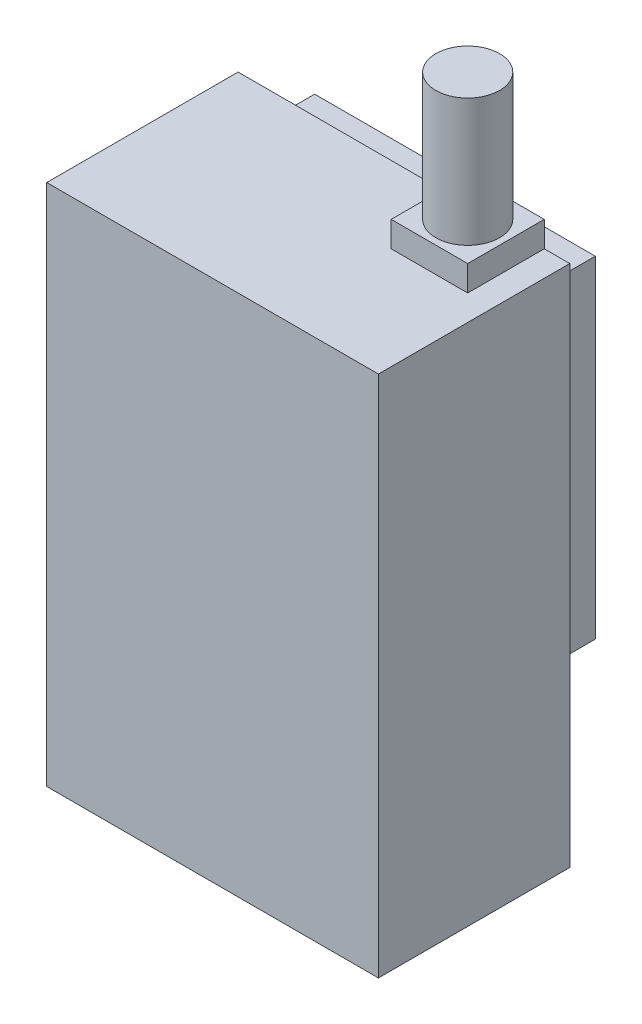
from build123d import *

# Parameters (mm, degrees)
CROQUIS1_W              = 26
CROQUIS1_H              = 41
SALIENTE_EXTRUIR1_DEPTH = 15
CROQUIS2_W              = 22
CROQUIS2_H              = 26
SALIENTE_EXTRUIR2_DEPTH = 3
CROQUIS5_W              = 6
CROQUIS5_H              = 6
SALIENTE_EXTRUIR3_DEPTH = 2
CROQUIS6_R              = 2.5
SALIENTE_EXTRUIR4_DEPTH = 10


with BuildPart() as part:
    # Croquis1 → Saliente-Extruir1 (new body)
    with BuildSketch(Plane.XY):
        with Locations((-16.320083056, 12.199792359)):
            Rectangle(CROQUIS1_W, CROQUIS1_H)
    extrude(amount=SALIENTE_EXTRUIR1_DEPTH)

    # Croquis2 → Saliente-Extruir2 (add)
    with BuildSketch(Plane(origin=(0, 0, 0), x_dir=(-1, 0, 0), z_dir=(0, 0, -1))):
        with Locations((15.320083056, 18.199792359)):
            Rectangle(CROQUIS2_W, CROQUIS2_H)
    extrude(amount=SALIENTE_EXTRUIR2_DEPTH)

    # Croquis5 → Saliente-Extruir3 (add)
    with BuildSketch(Plane(origin=(0, 32.699792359, 0), x_dir=(-1, 0, 0), z_dir=(0, 1, 0))):
        with Locations((8.320083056, 3)):
            Rectangle(CROQUIS5_W, CROQUIS5_H)
    extrude(amount=SALIENTE_EXTRUIR3_DEPTH)

    # Croquis6 → Saliente-Extruir4 (add)
    with BuildSketch(Plane(origin=(0, 34.699792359, 0), x_dir=(-1, 0, 0), z_dir=(0, 1, 0))):
        with Locations(Location((8.320083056, 3, 0), (0, 0, 90))):
            Circle(CROQUIS6_R)
    extrude(amount=SALIENTE_EXTRUIR4_DEPTH)


solid = part.part
